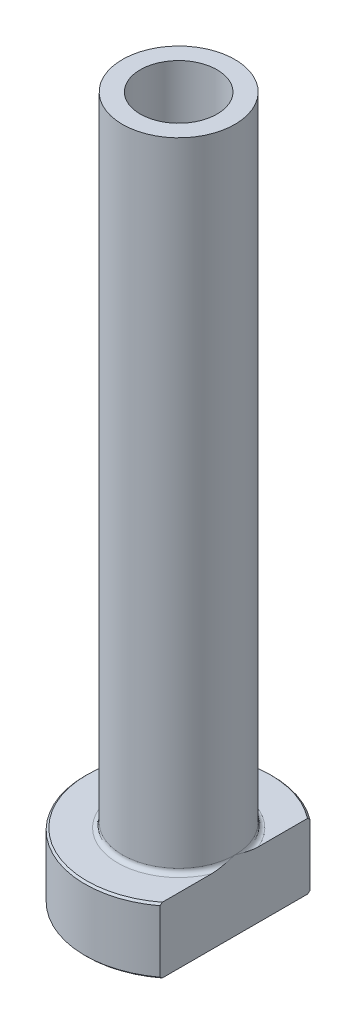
from build123d import *

# Parameters (mm, degrees)
FILLET1_R          = 0.5
CHAMFER1_SIZE      = 0.2
CUT_EXTRUDE1_DEPTH = 77.321687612
CHAMFER2_SIZE      = 0.5


with BuildPart() as part:
    # Sketch1 → Revolve1 (revolve)
    with BuildSketch(Plane.XY, mode=Mode.PRIVATE) as revolve1_sk:
        Polygon((-4.1, 75), (-6, 75), (-6, 7), (-10, 7), (-10, 0), (-4.35, 0), (-4.35, 18), (-4.1, 30), align=None)
    revolve(revolve1_sk.sketch.rotate(Axis((0, 92.187680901, 0), (0, -1, 0)), 270), axis=Axis((0, 92.187680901, 0), (0, -1, 0)))

    # Fillet1
    fillet1_edges = [part.edges().sort_by_distance(p)[0] for p in [
        (0, 7, -6),
    ]]
    fillet(fillet1_edges, radius=FILLET1_R)

    # Chamfer1
    chamfer1_edges = [part.edges().sort_by_distance(p)[0] for p in [
        (0, 0, -10),
        (0, 7, -10),
    ]]
    chamfer(chamfer1_edges, length=CHAMFER1_SIZE)

    # Sketch2 → Cut-Extrude1 (cut, through all)
    with BuildSketch(Plane.XZ):
        with BuildLine():
            Line((6, 8), (6, -8))
            ThreePointArc((6, -8), (10, 0), (6, 8))
        make_face()
    extrude(amount=-CUT_EXTRUDE1_DEPTH, mode=Mode.SUBTRACT)

    # Chamfer2
    chamfer2_edges = [part.edges().sort_by_distance(p)[0] for p in [
        (0, 0, -4.35),
    ]]
    chamfer(chamfer2_edges, length=CHAMFER2_SIZE)


solid = part.part
